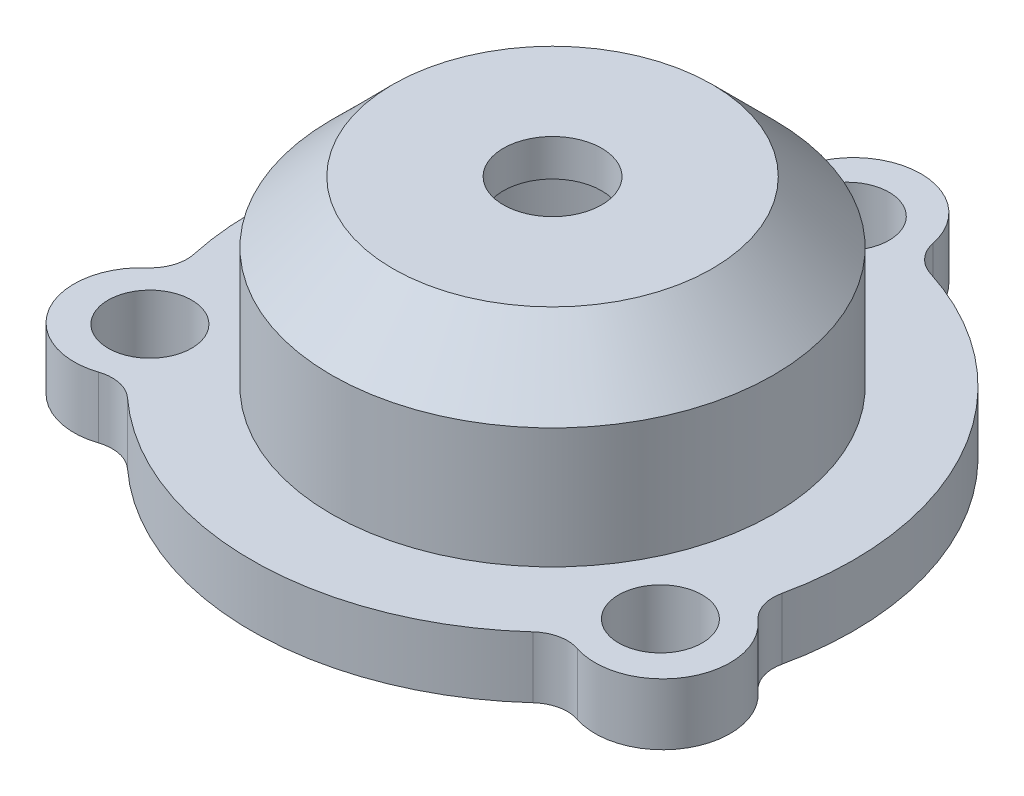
ISO-10303-21;
HEADER;
FILE_DESCRIPTION(('STEP AP214'),'2;1');
FILE_NAME('part.step','',(''),(''),'','','');
FILE_SCHEMA(('AUTOMOTIVE_DESIGN { 1 0 10303 214 1 1 1 1 }'));
ENDSEC;
DATA;
#1=APPLICATION_CONTEXT('core data for automotive mechanical design processes');
#2=APPLICATION_PROTOCOL_DEFINITION('international standard','automotive_design',2000,#1);
#3=PRODUCT_CONTEXT('',#1,'mechanical');
#4=PRODUCT('Part','Part','',(#3));
#5=PRODUCT_RELATED_PRODUCT_CATEGORY('part','',(#4));
#6=PRODUCT_DEFINITION_FORMATION('','',#4);
#7=PRODUCT_DEFINITION_CONTEXT('part definition',#1,'design');
#8=PRODUCT_DEFINITION('design','',#6,#7);
#9=PRODUCT_DEFINITION_SHAPE('','',#8);
#10=(LENGTH_UNIT() NAMED_UNIT(*) SI_UNIT(.MILLI.,.METRE.));
#11=(NAMED_UNIT(*) PLANE_ANGLE_UNIT() SI_UNIT($,.RADIAN.));
#12=(NAMED_UNIT(*) SI_UNIT($,.STERADIAN.) SOLID_ANGLE_UNIT());
#13=UNCERTAINTY_MEASURE_WITH_UNIT(LENGTH_MEASURE(1.E-05),#10,'distance_accuracy_value','');
#14=(GEOMETRIC_REPRESENTATION_CONTEXT(3) GLOBAL_UNCERTAINTY_ASSIGNED_CONTEXT((#13)) GLOBAL_UNIT_ASSIGNED_CONTEXT((#10,
#11,#12)) REPRESENTATION_CONTEXT('',''));
#15=CARTESIAN_POINT('',(0.,0.,0.));
#16=DIRECTION('',(0.,0.,1.));
#17=DIRECTION('',(1.,0.,0.));
#18=AXIS2_PLACEMENT_3D('',#15,#16,#17);
#19=CARTESIAN_POINT('',(0.,0.,0.));
#20=DIRECTION('',(0.,-1.,0.));
#21=DIRECTION('',(0.,0.,-1.));
#22=AXIS2_PLACEMENT_3D('',#19,#20,#21);
#23=CYLINDRICAL_SURFACE('',#22,2.);
#24=CARTESIAN_POINT('',(0.,9.9,0.));
#25=DIRECTION('',(0.,-1.,0.));
#26=DIRECTION('',(0.,0.,-1.));
#27=AXIS2_PLACEMENT_3D('',#24,#25,#26);
#28=CIRCLE('',#27,2.);
#29=CARTESIAN_POINT('',(0.,9.9,-2.));
#30=VERTEX_POINT('',#29);
#31=EDGE_CURVE('E20',#30,#30,#28,.F.);
#32=ORIENTED_EDGE('',*,*,#31,.T.);
#33=EDGE_LOOP('',(#32));
#34=FACE_BOUND('',#33,.T.);
#35=CARTESIAN_POINT('',(0.,8.4,0.));
#36=DIRECTION('',(0.,-1.,0.));
#37=DIRECTION('',(0.,0.,-1.));
#38=AXIS2_PLACEMENT_3D('',#35,#36,#37);
#39=CIRCLE('',#38,2.);
#40=CARTESIAN_POINT('',(0.,8.4,-2.));
#41=VERTEX_POINT('',#40);
#42=EDGE_CURVE('E206',#41,#41,#39,.T.);
#43=ORIENTED_EDGE('',*,*,#42,.T.);
#44=EDGE_LOOP('',(#43));
#45=FACE_BOUND('',#44,.T.);
#46=ADVANCED_FACE('F17',(#34,#45),#23,.F.);
#47=CARTESIAN_POINT('',(-2.,9.9,0.));
#48=DIRECTION('',(0.,-1.,0.));
#49=DIRECTION('',(0.,0.,-1.));
#50=AXIS2_PLACEMENT_3D('',#47,#48,#49);
#51=PLANE('',#50);
#52=ORIENTED_EDGE('',*,*,#31,.F.);
#53=EDGE_LOOP('',(#52));
#54=FACE_BOUND('',#53,.T.);
#55=CARTESIAN_POINT('',(0.,9.9,0.));
#56=DIRECTION('',(0.,-1.,0.));
#57=DIRECTION('',(0.,0.,-1.));
#58=AXIS2_PLACEMENT_3D('',#55,#56,#57);
#59=CIRCLE('',#58,6.49999999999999);
#60=CARTESIAN_POINT('',(0.,9.9,-6.49999999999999));
#61=VERTEX_POINT('',#60);
#62=EDGE_CURVE('E204',#61,#61,#59,.T.);
#63=ORIENTED_EDGE('',*,*,#62,.F.);
#64=EDGE_LOOP('',(#63));
#65=FACE_BOUND('',#64,.T.);
#66=ADVANCED_FACE('F214',(#54,#65),#51,.F.);
#67=CARTESIAN_POINT('',(-3.,8.4,0.));
#68=DIRECTION('',(0.,1.,0.));
#69=DIRECTION('',(0.,0.,1.));
#70=AXIS2_PLACEMENT_3D('',#67,#68,#69);
#71=PLANE('',#70);
#72=CARTESIAN_POINT('',(0.,8.4,0.));
#73=DIRECTION('',(0.,-1.,0.));
#74=DIRECTION('',(0.,0.,-1.));
#75=AXIS2_PLACEMENT_3D('',#72,#73,#74);
#76=CIRCLE('',#75,3.);
#77=CARTESIAN_POINT('',(0.,8.4,-3.));
#78=VERTEX_POINT('',#77);
#79=EDGE_CURVE('E201',#78,#78,#76,.T.);
#80=ORIENTED_EDGE('',*,*,#79,.T.);
#81=EDGE_LOOP('',(#80));
#82=FACE_BOUND('',#81,.T.);
#83=ORIENTED_EDGE('',*,*,#42,.F.);
#84=EDGE_LOOP('',(#83));
#85=FACE_BOUND('',#84,.T.);
#86=ADVANCED_FACE('F217',(#82,#85),#71,.F.);
#87=CARTESIAN_POINT('',(0.,7.4,0.));
#88=DIRECTION('',(0.,-1.,0.));
#89=DIRECTION('',(0.,0.,-1.));
#90=AXIS2_PLACEMENT_3D('',#87,#88,#89);
#91=CONICAL_SURFACE('',#90,9.,0.78539816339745);
#92=CARTESIAN_POINT('',(0.,7.4,0.));
#93=DIRECTION('',(0.,-1.,0.));
#94=DIRECTION('',(0.,0.,-1.));
#95=AXIS2_PLACEMENT_3D('',#92,#93,#94);
#96=CIRCLE('',#95,9.);
#97=CARTESIAN_POINT('',(0.,7.4,-9.));
#98=VERTEX_POINT('',#97);
#99=EDGE_CURVE('E200',#98,#98,#96,.T.);
#100=ORIENTED_EDGE('',*,*,#99,.F.);
#101=EDGE_LOOP('',(#100));
#102=FACE_BOUND('',#101,.T.);
#103=ORIENTED_EDGE('',*,*,#62,.T.);
#104=EDGE_LOOP('',(#103));
#105=FACE_BOUND('',#104,.T.);
#106=ADVANCED_FACE('F220',(#102,#105),#91,.T.);
#107=CARTESIAN_POINT('',(0.,0.,0.));
#108=DIRECTION('',(0.,-1.,0.));
#109=DIRECTION('',(0.,0.,-1.));
#110=AXIS2_PLACEMENT_3D('',#107,#108,#109);
#111=CYLINDRICAL_SURFACE('',#110,3.);
#112=ORIENTED_EDGE('',*,*,#79,.F.);
#113=EDGE_LOOP('',(#112));
#114=FACE_BOUND('',#113,.T.);
#115=CARTESIAN_POINT('',(0.,8.,0.));
#116=DIRECTION('',(0.,-1.,0.));
#117=DIRECTION('',(0.,0.,-1.));
#118=AXIS2_PLACEMENT_3D('',#115,#116,#117);
#119=CIRCLE('',#118,3.);
#120=CARTESIAN_POINT('',(0.,8.,-3.));
#121=VERTEX_POINT('',#120);
#122=EDGE_CURVE('E197',#121,#121,#119,.T.);
#123=ORIENTED_EDGE('',*,*,#122,.T.);
#124=EDGE_LOOP('',(#123));
#125=FACE_BOUND('',#124,.T.);
#126=ADVANCED_FACE('F222',(#114,#125),#111,.F.);
#127=CARTESIAN_POINT('',(0.,0.,0.));
#128=DIRECTION('',(0.,-1.,0.));
#129=DIRECTION('',(0.,0.,-1.));
#130=AXIS2_PLACEMENT_3D('',#127,#128,#129);
#131=CYLINDRICAL_SURFACE('',#130,9.);
#132=CARTESIAN_POINT('',(0.,2.5,0.));
#133=DIRECTION('',(0.,-1.,0.));
#134=DIRECTION('',(0.,0.,-1.));
#135=AXIS2_PLACEMENT_3D('',#132,#133,#134);
#136=CIRCLE('',#135,9.);
#137=CARTESIAN_POINT('',(0.,2.5,-9.));
#138=VERTEX_POINT('',#137);
#139=EDGE_CURVE('E173',#138,#138,#136,.F.);
#140=ORIENTED_EDGE('',*,*,#139,.T.);
#141=EDGE_LOOP('',(#140));
#142=FACE_BOUND('',#141,.T.);
#143=ORIENTED_EDGE('',*,*,#99,.T.);
#144=EDGE_LOOP('',(#143));
#145=FACE_BOUND('',#144,.T.);
#146=ADVANCED_FACE('F230',(#142,#145),#131,.T.);
#147=CARTESIAN_POINT('',(-6.,8.,0.));
#148=DIRECTION('',(0.,1.,0.));
#149=DIRECTION('',(0.,0.,1.));
#150=AXIS2_PLACEMENT_3D('',#147,#148,#149);
#151=PLANE('',#150);
#152=CARTESIAN_POINT('',(0.,8.,0.));
#153=DIRECTION('',(0.,-1.,0.));
#154=DIRECTION('',(0.,0.,-1.));
#155=AXIS2_PLACEMENT_3D('',#152,#153,#154);
#156=CIRCLE('',#155,6.);
#157=CARTESIAN_POINT('',(0.,8.,-6.));
#158=VERTEX_POINT('',#157);
#159=EDGE_CURVE('E161',#158,#158,#156,.T.);
#160=ORIENTED_EDGE('',*,*,#159,.T.);
#161=EDGE_LOOP('',(#160));
#162=FACE_BOUND('',#161,.T.);
#163=ORIENTED_EDGE('',*,*,#122,.F.);
#164=EDGE_LOOP('',(#163));
#165=FACE_BOUND('',#164,.T.);
#166=ADVANCED_FACE('F303',(#162,#165),#151,.F.);
#167=CARTESIAN_POINT('',(13.4305057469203,0.,2.94686534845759));
#168=DIRECTION('',(0.,1.,0.));
#169=DIRECTION('',(0.,0.,1.));
#170=AXIS2_PLACEMENT_3D('',#167,#168,#169);
#171=CYLINDRICAL_SURFACE('',#170,1.5);
#172=DIRECTION('',(0.,1.,0.));
#173=VECTOR('',#172,1.);
#174=CARTESIAN_POINT('',(12.4346135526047,0.,4.06855993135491));
#175=LINE('',#174,#173);
#176=CARTESIAN_POINT('',(12.4346135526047,0.,4.06855993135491));
#177=VERTEX_POINT('',#176);
#178=CARTESIAN_POINT('',(12.4346135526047,2.5,4.06855993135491));
#179=VERTEX_POINT('',#178);
#180=EDGE_CURVE('E160',#177,#179,#175,.T.);
#181=ORIENTED_EDGE('',*,*,#180,.F.);
#182=CARTESIAN_POINT('',(13.4305057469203,0.,2.94686534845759));
#183=DIRECTION('',(0.,1.,0.));
#184=DIRECTION('',(0.,0.,1.));
#185=AXIS2_PLACEMENT_3D('',#182,#183,#184);
#186=CIRCLE('',#185,1.5);
#187=CARTESIAN_POINT('',(11.9653596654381,0.,2.62538912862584));
#188=VERTEX_POINT('',#187);
#189=EDGE_CURVE('E70',#188,#177,#186,.T.);
#190=ORIENTED_EDGE('',*,*,#189,.F.);
#191=DIRECTION('',(0.,1.,0.));
#192=VECTOR('',#191,1.);
#193=CARTESIAN_POINT('',(11.9653596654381,0.,2.62538912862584));
#194=LINE('',#193,#192);
#195=CARTESIAN_POINT('',(11.9653596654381,2.5,2.62538912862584));
#196=VERTEX_POINT('',#195);
#197=EDGE_CURVE('E157',#196,#188,#194,.F.);
#198=ORIENTED_EDGE('',*,*,#197,.F.);
#199=CARTESIAN_POINT('',(13.4305057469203,2.5,2.94686534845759));
#200=DIRECTION('',(0.,1.,0.));
#201=DIRECTION('',(0.,0.,1.));
#202=AXIS2_PLACEMENT_3D('',#199,#200,#201);
#203=CIRCLE('',#202,1.5);
#204=EDGE_CURVE('E93',#196,#179,#203,.T.);
#205=ORIENTED_EDGE('',*,*,#204,.T.);
#206=EDGE_LOOP('',(#181,#190,#198,#205));
#207=FACE_BOUND('',#206,.T.);
#208=ADVANCED_FACE('F300',(#207),#171,.F.);
#209=CARTESIAN_POINT('',(4.16319262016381,0.,-13.1045918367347));
#210=DIRECTION('',(0.,1.,0.));
#211=DIRECTION('',(0.,0.,1.));
#212=AXIS2_PLACEMENT_3D('',#209,#210,#211);
#213=CYLINDRICAL_SURFACE('',#212,1.50000000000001);
#214=DIRECTION('',(0.,1.,0.));
#215=VECTOR('',#214,1.);
#216=CARTESIAN_POINT('',(3.70902615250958,0.,-11.675));
#217=LINE('',#216,#215);
#218=CARTESIAN_POINT('',(3.70902615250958,0.,-11.675));
#219=VERTEX_POINT('',#218);
#220=CARTESIAN_POINT('',(3.70902615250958,2.5,-11.675));
#221=VERTEX_POINT('',#220);
#222=EDGE_CURVE('E352',#219,#221,#217,.T.);
#223=ORIENTED_EDGE('',*,*,#222,.F.);
#224=CARTESIAN_POINT('',(4.16319262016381,0.,-13.1045918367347));
#225=DIRECTION('',(0.,1.,0.));
#226=DIRECTION('',(0.,0.,1.));
#227=AXIS2_PLACEMENT_3D('',#224,#225,#226);
#228=CIRCLE('',#227,1.50000000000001);
#229=CARTESIAN_POINT('',(2.69383051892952,0.,-12.8029711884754));
#230=VERTEX_POINT('',#229);
#231=EDGE_CURVE('E194',#230,#219,#228,.T.);
#232=ORIENTED_EDGE('',*,*,#231,.F.);
#233=DIRECTION('',(0.,1.,0.));
#234=VECTOR('',#233,1.);
#235=CARTESIAN_POINT('',(2.69383051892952,0.,-12.8029711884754));
#236=LINE('',#235,#234);
#237=CARTESIAN_POINT('',(2.69383051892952,2.5,-12.8029711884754));
#238=VERTEX_POINT('',#237);
#239=EDGE_CURVE('E349',#238,#230,#236,.F.);
#240=ORIENTED_EDGE('',*,*,#239,.F.);
#241=CARTESIAN_POINT('',(4.16319262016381,2.5,-13.1045918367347));
#242=DIRECTION('',(0.,1.,0.));
#243=DIRECTION('',(0.,0.,1.));
#244=AXIS2_PLACEMENT_3D('',#241,#242,#243);
#245=CIRCLE('',#244,1.50000000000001);
#246=EDGE_CURVE('E103',#238,#221,#245,.T.);
#247=ORIENTED_EDGE('',*,*,#246,.T.);
#248=EDGE_LOOP('',(#223,#232,#240,#247));
#249=FACE_BOUND('',#248,.T.);
#250=ADVANCED_FACE('F296',(#249),#213,.F.);
#251=CARTESIAN_POINT('',(-4.16319262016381,0.,-13.1045918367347));
#252=DIRECTION('',(0.,1.,0.));
#253=DIRECTION('',(0.,0.,1.));
#254=AXIS2_PLACEMENT_3D('',#251,#252,#253);
#255=CYLINDRICAL_SURFACE('',#254,1.5);
#256=DIRECTION('',(0.,1.,0.));
#257=VECTOR('',#256,1.);
#258=CARTESIAN_POINT('',(-2.69383051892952,0.,-12.8029711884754));
#259=LINE('',#258,#257);
#260=CARTESIAN_POINT('',(-2.69383051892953,0.,-12.8029711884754));
#261=VERTEX_POINT('',#260);
#262=CARTESIAN_POINT('',(-2.69383051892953,2.5,-12.8029711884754));
#263=VERTEX_POINT('',#262);
#264=EDGE_CURVE('E150',#261,#263,#259,.T.);
#265=ORIENTED_EDGE('',*,*,#264,.F.);
#266=CARTESIAN_POINT('',(-4.16319262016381,0.,-13.1045918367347));
#267=DIRECTION('',(0.,1.,0.));
#268=DIRECTION('',(0.,0.,1.));
#269=AXIS2_PLACEMENT_3D('',#266,#267,#268);
#270=CIRCLE('',#269,1.5);
#271=CARTESIAN_POINT('',(-3.70902615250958,0.,-11.675));
#272=VERTEX_POINT('',#271);
#273=EDGE_CURVE('E192',#272,#261,#270,.T.);
#274=ORIENTED_EDGE('',*,*,#273,.F.);
#275=DIRECTION('',(0.,1.,0.));
#276=VECTOR('',#275,1.);
#277=CARTESIAN_POINT('',(-3.70902615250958,0.,-11.675));
#278=LINE('',#277,#276);
#279=CARTESIAN_POINT('',(-3.70902615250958,2.5,-11.675));
#280=VERTEX_POINT('',#279);
#281=EDGE_CURVE('E141',#280,#272,#278,.F.);
#282=ORIENTED_EDGE('',*,*,#281,.F.);
#283=CARTESIAN_POINT('',(-4.16319262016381,2.5,-13.1045918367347));
#284=DIRECTION('',(0.,1.,0.));
#285=DIRECTION('',(0.,0.,1.));
#286=AXIS2_PLACEMENT_3D('',#283,#284,#285);
#287=CIRCLE('',#286,1.5);
#288=EDGE_CURVE('E129',#280,#263,#287,.T.);
#289=ORIENTED_EDGE('',*,*,#288,.T.);
#290=EDGE_LOOP('',(#265,#274,#282,#289));
#291=FACE_BOUND('',#290,.T.);
#292=ADVANCED_FACE('F293',(#291),#255,.F.);
#293=CARTESIAN_POINT('',(-13.4305057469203,0.,2.94686534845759));
#294=DIRECTION('',(0.,1.,0.));
#295=DIRECTION('',(0.,0.,1.));
#296=AXIS2_PLACEMENT_3D('',#293,#294,#295);
#297=CYLINDRICAL_SURFACE('',#296,1.5);
#298=DIRECTION('',(0.,1.,0.));
#299=VECTOR('',#298,1.);
#300=CARTESIAN_POINT('',(-11.9653596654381,0.,2.62538912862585));
#301=LINE('',#300,#299);
#302=CARTESIAN_POINT('',(-11.9653596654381,0.,2.62538912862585));
#303=VERTEX_POINT('',#302);
#304=CARTESIAN_POINT('',(-11.9653596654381,2.5,2.62538912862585));
#305=VERTEX_POINT('',#304);
#306=EDGE_CURVE('E122',#303,#305,#301,.T.);
#307=ORIENTED_EDGE('',*,*,#306,.F.);
#308=CARTESIAN_POINT('',(-13.4305057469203,0.,2.94686534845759));
#309=DIRECTION('',(0.,1.,0.));
#310=DIRECTION('',(0.,0.,1.));
#311=AXIS2_PLACEMENT_3D('',#308,#309,#310);
#312=CIRCLE('',#311,1.5);
#313=CARTESIAN_POINT('',(-12.4346135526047,0.,4.06855993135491));
#314=VERTEX_POINT('',#313);
#315=EDGE_CURVE('E190',#314,#303,#312,.T.);
#316=ORIENTED_EDGE('',*,*,#315,.F.);
#317=DIRECTION('',(0.,1.,0.));
#318=VECTOR('',#317,1.);
#319=CARTESIAN_POINT('',(-12.4346135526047,0.,4.06855993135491));
#320=LINE('',#319,#318);
#321=CARTESIAN_POINT('',(-12.4346135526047,2.5,4.06855993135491));
#322=VERTEX_POINT('',#321);
#323=EDGE_CURVE('E125',#322,#314,#320,.F.);
#324=ORIENTED_EDGE('',*,*,#323,.F.);
#325=CARTESIAN_POINT('',(-13.4305057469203,2.5,2.94686534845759));
#326=DIRECTION('',(0.,1.,0.));
#327=DIRECTION('',(0.,0.,1.));
#328=AXIS2_PLACEMENT_3D('',#325,#326,#327);
#329=CIRCLE('',#328,1.5);
#330=EDGE_CURVE('E119',#322,#305,#329,.T.);
#331=ORIENTED_EDGE('',*,*,#330,.T.);
#332=EDGE_LOOP('',(#307,#316,#324,#331));
#333=FACE_BOUND('',#332,.T.);
#334=ADVANCED_FACE('F121',(#333),#297,.F.);
#335=CARTESIAN_POINT('',(-9.26731312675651,0.,10.1577264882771));
#336=DIRECTION('',(0.,1.,0.));
#337=DIRECTION('',(0.,0.,1.));
#338=AXIS2_PLACEMENT_3D('',#335,#336,#337);
#339=CYLINDRICAL_SURFACE('',#338,1.5);
#340=DIRECTION('',(0.,1.,0.));
#341=VECTOR('',#340,1.);
#342=CARTESIAN_POINT('',(-9.74078303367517,0.,8.73441125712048));
#343=LINE('',#342,#341);
#344=CARTESIAN_POINT('',(-9.74078303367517,0.,8.73441125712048));
#345=VERTEX_POINT('',#344);
#346=CARTESIAN_POINT('',(-9.74078303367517,2.5,8.73441125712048));
#347=VERTEX_POINT('',#346);
#348=EDGE_CURVE('E189',#345,#347,#343,.T.);
#349=ORIENTED_EDGE('',*,*,#348,.F.);
#350=CARTESIAN_POINT('',(-9.26731312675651,0.,10.1577264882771));
#351=DIRECTION('',(0.,1.,0.));
#352=DIRECTION('',(0.,0.,1.));
#353=AXIS2_PLACEMENT_3D('',#350,#351,#352);
#354=CIRCLE('',#353,1.5);
#355=CARTESIAN_POINT('',(-8.25633351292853,0.,9.04961087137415));
#356=VERTEX_POINT('',#355);
#357=EDGE_CURVE('E186',#356,#345,#354,.T.);
#358=ORIENTED_EDGE('',*,*,#357,.F.);
#359=DIRECTION('',(0.,1.,0.));
#360=VECTOR('',#359,1.);
#361=CARTESIAN_POINT('',(-8.25633351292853,0.,9.04961087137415));
#362=LINE('',#361,#360);
#363=CARTESIAN_POINT('',(-8.25633351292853,2.5,9.04961087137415));
#364=VERTEX_POINT('',#363);
#365=EDGE_CURVE('E344',#364,#356,#362,.F.);
#366=ORIENTED_EDGE('',*,*,#365,.F.);
#367=CARTESIAN_POINT('',(-9.26731312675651,2.5,10.1577264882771));
#368=DIRECTION('',(0.,1.,0.));
#369=DIRECTION('',(0.,0.,1.));
#370=AXIS2_PLACEMENT_3D('',#367,#368,#369);
#371=CIRCLE('',#370,1.5);
#372=EDGE_CURVE('E130',#364,#347,#371,.T.);
#373=ORIENTED_EDGE('',*,*,#372,.T.);
#374=EDGE_LOOP('',(#349,#358,#366,#373));
#375=FACE_BOUND('',#374,.T.);
#376=ADVANCED_FACE('F286',(#375),#339,.F.);
#377=CARTESIAN_POINT('',(9.26731312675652,0.,10.1577264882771));
#378=DIRECTION('',(0.,1.,0.));
#379=DIRECTION('',(0.,0.,1.));
#380=AXIS2_PLACEMENT_3D('',#377,#378,#379);
#381=CYLINDRICAL_SURFACE('',#380,1.50000000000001);
#382=DIRECTION('',(0.,1.,0.));
#383=VECTOR('',#382,1.);
#384=CARTESIAN_POINT('',(8.25633351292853,0.,9.04961087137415));
#385=LINE('',#384,#383);
#386=CARTESIAN_POINT('',(8.25633351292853,0.,9.04961087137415));
#387=VERTEX_POINT('',#386);
#388=CARTESIAN_POINT('',(8.25633351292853,2.5,9.04961087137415));
#389=VERTEX_POINT('',#388);
#390=EDGE_CURVE('E76',#387,#389,#385,.T.);
#391=ORIENTED_EDGE('',*,*,#390,.F.);
#392=CARTESIAN_POINT('',(9.26731312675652,0.,10.1577264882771));
#393=DIRECTION('',(0.,1.,0.));
#394=DIRECTION('',(0.,0.,1.));
#395=AXIS2_PLACEMENT_3D('',#392,#393,#394);
#396=CIRCLE('',#395,1.50000000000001);
#397=CARTESIAN_POINT('',(9.74078303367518,0.,8.73441125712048));
#398=VERTEX_POINT('',#397);
#399=EDGE_CURVE('E183',#398,#387,#396,.T.);
#400=ORIENTED_EDGE('',*,*,#399,.F.);
#401=DIRECTION('',(0.,1.,0.));
#402=VECTOR('',#401,1.);
#403=CARTESIAN_POINT('',(9.74078303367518,0.,8.73441125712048));
#404=LINE('',#403,#402);
#405=CARTESIAN_POINT('',(9.74078303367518,2.5,8.73441125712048));
#406=VERTEX_POINT('',#405);
#407=EDGE_CURVE('E185',#406,#398,#404,.F.);
#408=ORIENTED_EDGE('',*,*,#407,.F.);
#409=CARTESIAN_POINT('',(9.26731312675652,2.5,10.1577264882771));
#410=DIRECTION('',(0.,1.,0.));
#411=DIRECTION('',(0.,0.,1.));
#412=AXIS2_PLACEMENT_3D('',#409,#410,#411);
#413=CIRCLE('',#412,1.50000000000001);
#414=EDGE_CURVE('E180',#406,#389,#413,.T.);
#415=ORIENTED_EDGE('',*,*,#414,.T.);
#416=EDGE_LOOP('',(#391,#400,#408,#415));
#417=FACE_BOUND('',#416,.T.);
#418=ADVANCED_FACE('F282',(#417),#381,.F.);
#419=CARTESIAN_POINT('',(-9.,2.5,0.));
#420=DIRECTION('',(0.,-1.,0.));
#421=DIRECTION('',(0.,0.,-1.));
#422=AXIS2_PLACEMENT_3D('',#419,#420,#421);
#423=PLANE('',#422);
#424=CARTESIAN_POINT('',(-10.3923048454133,2.5,5.9999999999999));
#425=DIRECTION('',(0.,1.,0.));
#426=DIRECTION('',(0.,0.,1.));
#427=AXIS2_PLACEMENT_3D('',#424,#425,#426);
#428=CIRCLE('',#427,1.7);
#429=CARTESIAN_POINT('',(-10.3923048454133,2.5,7.6999999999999));
#430=VERTEX_POINT('',#429);
#431=EDGE_CURVE('E170',#430,#430,#428,.F.);
#432=ORIENTED_EDGE('',*,*,#431,.T.);
#433=EDGE_LOOP('',(#432));
#434=FACE_BOUND('',#433,.T.);
#435=CARTESIAN_POINT('',(10.3923048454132,2.5,6.00000000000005));
#436=DIRECTION('',(0.,1.,0.));
#437=DIRECTION('',(0.,0.,1.));
#438=AXIS2_PLACEMENT_3D('',#435,#436,#437);
#439=CIRCLE('',#438,1.7);
#440=CARTESIAN_POINT('',(10.3923048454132,2.5,7.70000000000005));
#441=VERTEX_POINT('',#440);
#442=EDGE_CURVE('E167',#441,#441,#439,.F.);
#443=ORIENTED_EDGE('',*,*,#442,.T.);
#444=EDGE_LOOP('',(#443));
#445=FACE_BOUND('',#444,.T.);
#446=CARTESIAN_POINT('',(0.,2.5,-12.));
#447=DIRECTION('',(0.,1.,0.));
#448=DIRECTION('',(0.,0.,1.));
#449=AXIS2_PLACEMENT_3D('',#446,#447,#448);
#450=CIRCLE('',#449,1.7);
#451=CARTESIAN_POINT('',(0.,2.5,-10.3));
#452=VERTEX_POINT('',#451);
#453=EDGE_CURVE('E164',#452,#452,#450,.F.);
#454=ORIENTED_EDGE('',*,*,#453,.T.);
#455=EDGE_LOOP('',(#454));
#456=FACE_BOUND('',#455,.T.);
#457=ORIENTED_EDGE('',*,*,#139,.F.);
#458=EDGE_LOOP('',(#457));
#459=FACE_BOUND('',#458,.T.);
#460=ORIENTED_EDGE('',*,*,#246,.F.);
#461=CARTESIAN_POINT('',(0.,2.5,-12.25));
#462=DIRECTION('',(0.,1.,0.));
#463=DIRECTION('',(0.,0.,1.));
#464=AXIS2_PLACEMENT_3D('',#461,#462,#463);
#465=CIRCLE('',#464,2.75);
#466=EDGE_CURVE('E146',#263,#238,#465,.F.);
#467=ORIENTED_EDGE('',*,*,#466,.F.);
#468=ORIENTED_EDGE('',*,*,#288,.F.);
#469=CARTESIAN_POINT('',(0.,2.5,0.));
#470=DIRECTION('',(0.,1.,0.));
#471=DIRECTION('',(0.,0.,1.));
#472=AXIS2_PLACEMENT_3D('',#469,#470,#471);
#473=CIRCLE('',#472,12.25);
#474=EDGE_CURVE('E136',#305,#280,#473,.F.);
#475=ORIENTED_EDGE('',*,*,#474,.F.);
#476=ORIENTED_EDGE('',*,*,#330,.F.);
#477=CARTESIAN_POINT('',(-10.6088111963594,2.5,6.125));
#478=DIRECTION('',(0.,1.,0.));
#479=DIRECTION('',(0.,0.,1.));
#480=AXIS2_PLACEMENT_3D('',#477,#478,#479);
#481=CIRCLE('',#480,2.75);
#482=EDGE_CURVE('E140',#347,#322,#481,.F.);
#483=ORIENTED_EDGE('',*,*,#482,.F.);
#484=ORIENTED_EDGE('',*,*,#372,.F.);
#485=CARTESIAN_POINT('',(0.,2.5,0.));
#486=DIRECTION('',(0.,1.,0.));
#487=DIRECTION('',(0.,0.,1.));
#488=AXIS2_PLACEMENT_3D('',#485,#486,#487);
#489=CIRCLE('',#488,12.25);
#490=EDGE_CURVE('E341',#389,#364,#489,.F.);
#491=ORIENTED_EDGE('',*,*,#490,.F.);
#492=ORIENTED_EDGE('',*,*,#414,.F.);
#493=CARTESIAN_POINT('',(10.6088111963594,2.5,6.125));
#494=DIRECTION('',(0.,1.,0.));
#495=DIRECTION('',(0.,0.,1.));
#496=AXIS2_PLACEMENT_3D('',#493,#494,#495);
#497=CIRCLE('',#496,2.75);
#498=EDGE_CURVE('E158',#179,#406,#497,.F.);
#499=ORIENTED_EDGE('',*,*,#498,.F.);
#500=ORIENTED_EDGE('',*,*,#204,.F.);
#501=CARTESIAN_POINT('',(0.,2.5,0.));
#502=DIRECTION('',(0.,1.,0.));
#503=DIRECTION('',(0.,0.,1.));
#504=AXIS2_PLACEMENT_3D('',#501,#502,#503);
#505=CIRCLE('',#504,12.25);
#506=EDGE_CURVE('E155',#221,#196,#505,.F.);
#507=ORIENTED_EDGE('',*,*,#506,.F.);
#508=EDGE_LOOP('',(#460,#467,#468,#475,#476,#483,#484,#491,#492,#499,#500,#507));
#509=FACE_BOUND('',#508,.T.);
#510=ADVANCED_FACE('F143',(#434,#445,#456,#459,#509),#423,.F.);
#511=CARTESIAN_POINT('',(-10.3923048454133,2.5,5.9999999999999));
#512=DIRECTION('',(0.,1.,0.));
#513=DIRECTION('',(0.,0.,1.));
#514=AXIS2_PLACEMENT_3D('',#511,#512,#513);
#515=CYLINDRICAL_SURFACE('',#514,1.7);
#516=CARTESIAN_POINT('',(-10.3923048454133,0.,5.9999999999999));
#517=DIRECTION('',(0.,1.,0.));
#518=DIRECTION('',(0.,0.,1.));
#519=AXIS2_PLACEMENT_3D('',#516,#517,#518);
#520=CIRCLE('',#519,1.7);
#521=CARTESIAN_POINT('',(-10.3923048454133,0.,7.6999999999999));
#522=VERTEX_POINT('',#521);
#523=EDGE_CURVE('E339',#522,#522,#520,.F.);
#524=ORIENTED_EDGE('',*,*,#523,.T.);
#525=EDGE_LOOP('',(#524));
#526=FACE_BOUND('',#525,.T.);
#527=ORIENTED_EDGE('',*,*,#431,.F.);
#528=EDGE_LOOP('',(#527));
#529=FACE_BOUND('',#528,.T.);
#530=ADVANCED_FACE('F275',(#526,#529),#515,.F.);
#531=CARTESIAN_POINT('',(10.3923048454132,2.5,6.00000000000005));
#532=DIRECTION('',(0.,1.,0.));
#533=DIRECTION('',(0.,0.,1.));
#534=AXIS2_PLACEMENT_3D('',#531,#532,#533);
#535=CYLINDRICAL_SURFACE('',#534,1.7);
#536=CARTESIAN_POINT('',(10.3923048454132,0.,6.00000000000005));
#537=DIRECTION('',(0.,1.,0.));
#538=DIRECTION('',(0.,0.,1.));
#539=AXIS2_PLACEMENT_3D('',#536,#537,#538);
#540=CIRCLE('',#539,1.7);
#541=CARTESIAN_POINT('',(10.3923048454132,0.,7.70000000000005));
#542=VERTEX_POINT('',#541);
#543=EDGE_CURVE('E336',#542,#542,#540,.F.);
#544=ORIENTED_EDGE('',*,*,#543,.T.);
#545=EDGE_LOOP('',(#544));
#546=FACE_BOUND('',#545,.T.);
#547=ORIENTED_EDGE('',*,*,#442,.F.);
#548=EDGE_LOOP('',(#547));
#549=FACE_BOUND('',#548,.T.);
#550=ADVANCED_FACE('F271',(#546,#549),#535,.F.);
#551=CARTESIAN_POINT('',(0.,2.5,-12.));
#552=DIRECTION('',(0.,1.,0.));
#553=DIRECTION('',(0.,0.,1.));
#554=AXIS2_PLACEMENT_3D('',#551,#552,#553);
#555=CYLINDRICAL_SURFACE('',#554,1.7);
#556=CARTESIAN_POINT('',(0.,0.,-12.));
#557=DIRECTION('',(0.,1.,0.));
#558=DIRECTION('',(0.,0.,1.));
#559=AXIS2_PLACEMENT_3D('',#556,#557,#558);
#560=CIRCLE('',#559,1.7);
#561=CARTESIAN_POINT('',(0.,0.,-10.3));
#562=VERTEX_POINT('',#561);
#563=EDGE_CURVE('E333',#562,#562,#560,.F.);
#564=ORIENTED_EDGE('',*,*,#563,.T.);
#565=EDGE_LOOP('',(#564));
#566=FACE_BOUND('',#565,.T.);
#567=ORIENTED_EDGE('',*,*,#453,.F.);
#568=EDGE_LOOP('',(#567));
#569=FACE_BOUND('',#568,.T.);
#570=ADVANCED_FACE('F267',(#566,#569),#555,.F.);
#571=CARTESIAN_POINT('',(0.,0.,0.));
#572=DIRECTION('',(0.,-1.,0.));
#573=DIRECTION('',(0.,0.,-1.));
#574=AXIS2_PLACEMENT_3D('',#571,#572,#573);
#575=CYLINDRICAL_SURFACE('',#574,6.);
#576=ORIENTED_EDGE('',*,*,#159,.F.);
#577=EDGE_LOOP('',(#576));
#578=FACE_BOUND('',#577,.T.);
#579=CARTESIAN_POINT('',(0.,0.,0.));
#580=DIRECTION('',(0.,-1.,0.));
#581=DIRECTION('',(0.,0.,-1.));
#582=AXIS2_PLACEMENT_3D('',#579,#580,#581);
#583=CIRCLE('',#582,6.);
#584=CARTESIAN_POINT('',(0.,0.,-6.));
#585=VERTEX_POINT('',#584);
#586=EDGE_CURVE('E330',#585,#585,#583,.T.);
#587=ORIENTED_EDGE('',*,*,#586,.T.);
#588=EDGE_LOOP('',(#587));
#589=FACE_BOUND('',#588,.T.);
#590=ADVANCED_FACE('F263',(#578,#589),#575,.F.);
#591=CARTESIAN_POINT('',(10.6088111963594,0.,6.125));
#592=DIRECTION('',(0.,1.,0.));
#593=DIRECTION('',(0.,0.,1.));
#594=AXIS2_PLACEMENT_3D('',#591,#592,#593);
#595=CYLINDRICAL_SURFACE('',#594,2.75);
#596=ORIENTED_EDGE('',*,*,#180,.T.);
#597=ORIENTED_EDGE('',*,*,#498,.T.);
#598=ORIENTED_EDGE('',*,*,#407,.T.);
#599=CARTESIAN_POINT('',(10.6088111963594,0.,6.125));
#600=DIRECTION('',(0.,1.,0.));
#601=DIRECTION('',(0.,0.,1.));
#602=AXIS2_PLACEMENT_3D('',#599,#600,#601);
#603=CIRCLE('',#602,2.75);
#604=EDGE_CURVE('E327',#398,#177,#603,.T.);
#605=ORIENTED_EDGE('',*,*,#604,.T.);
#606=EDGE_LOOP('',(#596,#597,#598,#605));
#607=FACE_BOUND('',#606,.T.);
#608=ADVANCED_FACE('F259',(#607),#595,.T.);
#609=CARTESIAN_POINT('',(0.,0.,0.));
#610=DIRECTION('',(0.,1.,0.));
#611=DIRECTION('',(0.,0.,1.));
#612=AXIS2_PLACEMENT_3D('',#609,#610,#611);
#613=CYLINDRICAL_SURFACE('',#612,12.25);
#614=CARTESIAN_POINT('',(0.,0.,0.));
#615=DIRECTION('',(0.,1.,0.));
#616=DIRECTION('',(0.,0.,1.));
#617=AXIS2_PLACEMENT_3D('',#614,#615,#616);
#618=CIRCLE('',#617,12.25);
#619=EDGE_CURVE('E324',#188,#219,#618,.T.);
#620=ORIENTED_EDGE('',*,*,#619,.T.);
#621=ORIENTED_EDGE('',*,*,#222,.T.);
#622=ORIENTED_EDGE('',*,*,#506,.T.);
#623=ORIENTED_EDGE('',*,*,#197,.T.);
#624=EDGE_LOOP('',(#620,#621,#622,#623));
#625=FACE_BOUND('',#624,.T.);
#626=ADVANCED_FACE('F255',(#625),#613,.T.);
#627=CARTESIAN_POINT('',(0.,0.,-12.25));
#628=DIRECTION('',(0.,1.,0.));
#629=DIRECTION('',(0.,0.,1.));
#630=AXIS2_PLACEMENT_3D('',#627,#628,#629);
#631=CYLINDRICAL_SURFACE('',#630,2.75);
#632=ORIENTED_EDGE('',*,*,#264,.T.);
#633=ORIENTED_EDGE('',*,*,#466,.T.);
#634=ORIENTED_EDGE('',*,*,#239,.T.);
#635=CARTESIAN_POINT('',(0.,0.,-12.25));
#636=DIRECTION('',(0.,1.,0.));
#637=DIRECTION('',(0.,0.,1.));
#638=AXIS2_PLACEMENT_3D('',#635,#636,#637);
#639=CIRCLE('',#638,2.75);
#640=EDGE_CURVE('E321',#230,#261,#639,.T.);
#641=ORIENTED_EDGE('',*,*,#640,.T.);
#642=EDGE_LOOP('',(#632,#633,#634,#641));
#643=FACE_BOUND('',#642,.T.);
#644=ADVANCED_FACE('F252',(#643),#631,.T.);
#645=CARTESIAN_POINT('',(0.,0.,0.));
#646=DIRECTION('',(0.,1.,0.));
#647=DIRECTION('',(0.,0.,1.));
#648=AXIS2_PLACEMENT_3D('',#645,#646,#647);
#649=CYLINDRICAL_SURFACE('',#648,12.25);
#650=CARTESIAN_POINT('',(0.,0.,0.));
#651=DIRECTION('',(0.,1.,0.));
#652=DIRECTION('',(0.,0.,1.));
#653=AXIS2_PLACEMENT_3D('',#650,#651,#652);
#654=CIRCLE('',#653,12.25);
#655=EDGE_CURVE('E139',#272,#303,#654,.T.);
#656=ORIENTED_EDGE('',*,*,#655,.T.);
#657=ORIENTED_EDGE('',*,*,#306,.T.);
#658=ORIENTED_EDGE('',*,*,#474,.T.);
#659=ORIENTED_EDGE('',*,*,#281,.T.);
#660=EDGE_LOOP('',(#656,#657,#658,#659));
#661=FACE_BOUND('',#660,.T.);
#662=ADVANCED_FACE('F134',(#661),#649,.T.);
#663=CARTESIAN_POINT('',(-10.6088111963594,0.,6.125));
#664=DIRECTION('',(0.,1.,0.));
#665=DIRECTION('',(0.,0.,1.));
#666=AXIS2_PLACEMENT_3D('',#663,#664,#665);
#667=CYLINDRICAL_SURFACE('',#666,2.75);
#668=ORIENTED_EDGE('',*,*,#482,.T.);
#669=ORIENTED_EDGE('',*,*,#323,.T.);
#670=CARTESIAN_POINT('',(-10.6088111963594,0.,6.125));
#671=DIRECTION('',(0.,1.,0.));
#672=DIRECTION('',(0.,0.,1.));
#673=AXIS2_PLACEMENT_3D('',#670,#671,#672);
#674=CIRCLE('',#673,2.75);
#675=EDGE_CURVE('E26',#314,#345,#674,.T.);
#676=ORIENTED_EDGE('',*,*,#675,.T.);
#677=ORIENTED_EDGE('',*,*,#348,.T.);
#678=EDGE_LOOP('',(#668,#669,#676,#677));
#679=FACE_BOUND('',#678,.T.);
#680=ADVANCED_FACE('F243',(#679),#667,.T.);
#681=CARTESIAN_POINT('',(0.,0.,0.));
#682=DIRECTION('',(0.,1.,0.));
#683=DIRECTION('',(0.,0.,1.));
#684=AXIS2_PLACEMENT_3D('',#681,#682,#683);
#685=CYLINDRICAL_SURFACE('',#684,12.25);
#686=ORIENTED_EDGE('',*,*,#390,.T.);
#687=ORIENTED_EDGE('',*,*,#490,.T.);
#688=ORIENTED_EDGE('',*,*,#365,.T.);
#689=CARTESIAN_POINT('',(0.,0.,0.));
#690=DIRECTION('',(0.,1.,0.));
#691=DIRECTION('',(0.,0.,1.));
#692=AXIS2_PLACEMENT_3D('',#689,#690,#691);
#693=CIRCLE('',#692,12.25);
#694=EDGE_CURVE('E11',#356,#387,#693,.T.);
#695=ORIENTED_EDGE('',*,*,#694,.T.);
#696=EDGE_LOOP('',(#686,#687,#688,#695));
#697=FACE_BOUND('',#696,.T.);
#698=ADVANCED_FACE('F238',(#697),#685,.T.);
#699=CARTESIAN_POINT('',(-15.,0.,0.));
#700=DIRECTION('',(0.,1.,0.));
#701=DIRECTION('',(0.,0.,1.));
#702=AXIS2_PLACEMENT_3D('',#699,#700,#701);
#703=PLANE('',#702);
#704=ORIENTED_EDGE('',*,*,#399,.T.);
#705=ORIENTED_EDGE('',*,*,#694,.F.);
#706=ORIENTED_EDGE('',*,*,#357,.T.);
#707=ORIENTED_EDGE('',*,*,#675,.F.);
#708=ORIENTED_EDGE('',*,*,#315,.T.);
#709=ORIENTED_EDGE('',*,*,#655,.F.);
#710=ORIENTED_EDGE('',*,*,#273,.T.);
#711=ORIENTED_EDGE('',*,*,#640,.F.);
#712=ORIENTED_EDGE('',*,*,#231,.T.);
#713=ORIENTED_EDGE('',*,*,#619,.F.);
#714=ORIENTED_EDGE('',*,*,#189,.T.);
#715=ORIENTED_EDGE('',*,*,#604,.F.);
#716=EDGE_LOOP('',(#704,#705,#706,#707,#708,#709,#710,#711,#712,#713,#714,#715));
#717=FACE_BOUND('',#716,.T.);
#718=ORIENTED_EDGE('',*,*,#586,.F.);
#719=EDGE_LOOP('',(#718));
#720=FACE_BOUND('',#719,.T.);
#721=ORIENTED_EDGE('',*,*,#563,.F.);
#722=EDGE_LOOP('',(#721));
#723=FACE_BOUND('',#722,.T.);
#724=ORIENTED_EDGE('',*,*,#543,.F.);
#725=EDGE_LOOP('',(#724));
#726=FACE_BOUND('',#725,.T.);
#727=ORIENTED_EDGE('',*,*,#523,.F.);
#728=EDGE_LOOP('',(#727));
#729=FACE_BOUND('',#728,.T.);
#730=ADVANCED_FACE('F236',(#717,#720,#723,#726,#729),#703,.F.);
#731=CLOSED_SHELL('',(#46,#66,#86,#106,#126,#146,#166,#208,#250,#292,#334,#376,#418,#510,#530,
#550,#570,#590,#608,#626,#644,#662,#680,#698,#730));
#732=MANIFOLD_SOLID_BREP('B1',#731);
#733=ADVANCED_BREP_SHAPE_REPRESENTATION('',(#18,#732),#14);
#734=SHAPE_DEFINITION_REPRESENTATION(#9,#733);
ENDSEC;
END-ISO-10303-21;
